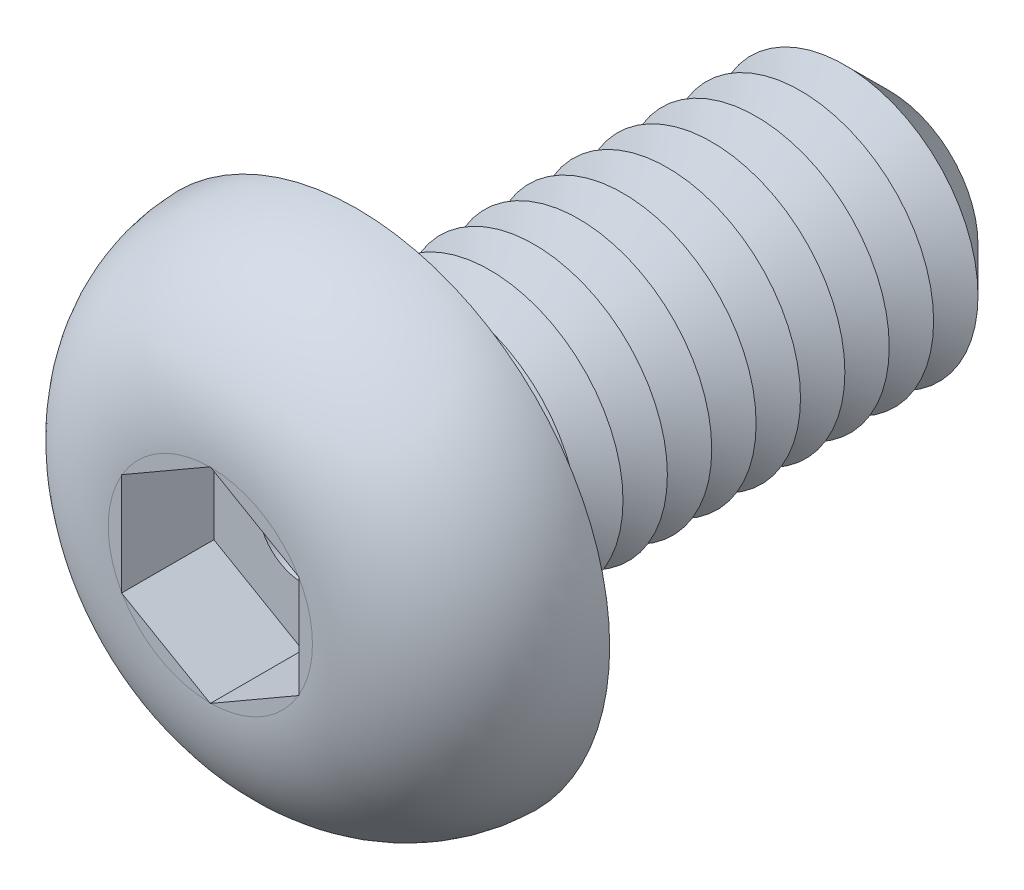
ISO-10303-21;
HEADER;
FILE_DESCRIPTION(('STEP AP214'),'2;1');
FILE_NAME('part.step','',(''),(''),'','','');
FILE_SCHEMA(('AUTOMOTIVE_DESIGN { 1 0 10303 214 1 1 1 1 }'));
ENDSEC;
DATA;
#1=APPLICATION_CONTEXT('core data for automotive mechanical design processes');
#2=APPLICATION_PROTOCOL_DEFINITION('international standard','automotive_design',2000,#1);
#3=PRODUCT_CONTEXT('',#1,'mechanical');
#4=PRODUCT('Part','Part','',(#3));
#5=PRODUCT_RELATED_PRODUCT_CATEGORY('part','',(#4));
#6=PRODUCT_DEFINITION_FORMATION('','',#4);
#7=PRODUCT_DEFINITION_CONTEXT('part definition',#1,'design');
#8=PRODUCT_DEFINITION('design','',#6,#7);
#9=PRODUCT_DEFINITION_SHAPE('','',#8);
#10=(LENGTH_UNIT() NAMED_UNIT(*) SI_UNIT(.MILLI.,.METRE.));
#11=(NAMED_UNIT(*) PLANE_ANGLE_UNIT() SI_UNIT($,.RADIAN.));
#12=(NAMED_UNIT(*) SI_UNIT($,.STERADIAN.) SOLID_ANGLE_UNIT());
#13=UNCERTAINTY_MEASURE_WITH_UNIT(LENGTH_MEASURE(1.E-05),#10,'distance_accuracy_value','');
#14=(GEOMETRIC_REPRESENTATION_CONTEXT(3) GLOBAL_UNCERTAINTY_ASSIGNED_CONTEXT((#13)) GLOBAL_UNIT_ASSIGNED_CONTEXT((#10,
#11,#12)) REPRESENTATION_CONTEXT('',''));
#15=CARTESIAN_POINT('',(0.,0.,0.));
#16=DIRECTION('',(0.,0.,1.));
#17=DIRECTION('',(1.,0.,0.));
#18=AXIS2_PLACEMENT_3D('',#15,#16,#17);
#19=CARTESIAN_POINT('',(0.,0.,-6.));
#20=DIRECTION('',(0.,0.,1.));
#21=DIRECTION('',(1.,0.,0.));
#22=AXIS2_PLACEMENT_3D('',#19,#20,#21);
#23=CYLINDRICAL_SURFACE('',#22,1.5);
#24=CARTESIAN_POINT('',(0.,0.,-0.25));
#25=DIRECTION('',(0.,0.,1.));
#26=DIRECTION('',(1.,0.,0.));
#27=AXIS2_PLACEMENT_3D('',#24,#25,#26);
#28=CIRCLE('',#27,1.5);
#29=CARTESIAN_POINT('',(1.5,0.,-0.25));
#30=VERTEX_POINT('',#29);
#31=EDGE_CURVE('E48',#30,#30,#28,.F.);
#32=ORIENTED_EDGE('',*,*,#31,.T.);
#33=EDGE_LOOP('',(#32));
#34=FACE_BOUND('',#33,.T.);
#35=CARTESIAN_POINT('',(0.,0.,-0.5));
#36=DIRECTION('',(0.,0.,1.));
#37=DIRECTION('',(1.,0.,0.));
#38=AXIS2_PLACEMENT_3D('',#35,#36,#37);
#39=CIRCLE('',#38,1.5);
#40=CARTESIAN_POINT('',(1.5,0.,-0.5));
#41=VERTEX_POINT('',#40);
#42=EDGE_CURVE('E160',#41,#41,#39,.T.);
#43=ORIENTED_EDGE('',*,*,#42,.T.);
#44=EDGE_LOOP('',(#43));
#45=FACE_BOUND('',#44,.T.);
#46=ADVANCED_FACE('F39',(#34,#45),#23,.T.);
#47=CARTESIAN_POINT('',(0.,0.,1.65));
#48=DIRECTION('',(0.,0.,-1.));
#49=DIRECTION('',(-1.,0.,0.));
#50=AXIS2_PLACEMENT_3D('',#47,#48,#49);
#51=PLANE('',#50);
#52=CARTESIAN_POINT('',(0.,0.,1.65));
#53=DIRECTION('',(0.,0.,1.));
#54=DIRECTION('',(1.,0.,0.));
#55=AXIS2_PLACEMENT_3D('',#52,#53,#54);
#56=CIRCLE('',#55,1.15073545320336);
#57=CARTESIAN_POINT('',(0.993096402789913,0.581336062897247,1.65));
#58=VERTEX_POINT('',#57);
#59=CARTESIAN_POINT('',(0.00690359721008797,1.15071474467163,1.65));
#60=VERTEX_POINT('',#59);
#61=EDGE_CURVE('E220',#58,#60,#56,.T.);
#62=ORIENTED_EDGE('',*,*,#61,.T.);
#63=DIRECTION('',(-0.866025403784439,0.5,0.));
#64=VECTOR('',#63,1.);
#65=CARTESIAN_POINT('',(1.,0.577350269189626,1.65));
#66=LINE('',#65,#64);
#67=EDGE_CURVE('E178',#58,#60,#66,.T.);
#68=ORIENTED_EDGE('',*,*,#67,.F.);
#69=EDGE_LOOP('',(#62,#68));
#70=FACE_BOUND('',#69,.T.);
#71=ADVANCED_FACE('F257',(#70),#51,.F.);
#72=CARTESIAN_POINT('',(1.,-0.569378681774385,1.65));
#73=VERTEX_POINT('',#72);
#74=CARTESIAN_POINT('',(1.,0.569378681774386,1.65));
#75=VERTEX_POINT('',#74);
#76=EDGE_CURVE('E215',#73,#75,#56,.T.);
#77=ORIENTED_EDGE('',*,*,#76,.T.);
#78=DIRECTION('',(0.,1.,0.));
#79=VECTOR('',#78,1.);
#80=CARTESIAN_POINT('',(1.,-0.577350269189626,1.65));
#81=LINE('',#80,#79);
#82=EDGE_CURVE('E63',#73,#75,#81,.T.);
#83=ORIENTED_EDGE('',*,*,#82,.F.);
#84=EDGE_LOOP('',(#77,#83));
#85=FACE_BOUND('',#84,.T.);
#86=ADVANCED_FACE('F263',(#85),#51,.F.);
#87=CARTESIAN_POINT('',(0.00690359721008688,-1.15071474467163,1.65));
#88=VERTEX_POINT('',#87);
#89=CARTESIAN_POINT('',(0.993096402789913,-0.581336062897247,1.65));
#90=VERTEX_POINT('',#89);
#91=EDGE_CURVE('E219',#88,#90,#56,.T.);
#92=ORIENTED_EDGE('',*,*,#91,.T.);
#93=DIRECTION('',(0.866025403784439,0.5,0.));
#94=VECTOR('',#93,1.);
#95=CARTESIAN_POINT('',(0.,-1.15470053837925,1.65));
#96=LINE('',#95,#94);
#97=EDGE_CURVE('E190',#88,#90,#96,.T.);
#98=ORIENTED_EDGE('',*,*,#97,.F.);
#99=EDGE_LOOP('',(#92,#98));
#100=FACE_BOUND('',#99,.T.);
#101=ADVANCED_FACE('F326',(#100),#51,.F.);
#102=CARTESIAN_POINT('',(-0.993096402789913,-0.581336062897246,1.65));
#103=VERTEX_POINT('',#102);
#104=CARTESIAN_POINT('',(-0.00690359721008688,-1.15071474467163,1.65));
#105=VERTEX_POINT('',#104);
#106=EDGE_CURVE('E336',#103,#105,#56,.T.);
#107=ORIENTED_EDGE('',*,*,#106,.T.);
#108=DIRECTION('',(0.866025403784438,-0.5,0.));
#109=VECTOR('',#108,1.);
#110=CARTESIAN_POINT('',(-1.,-0.577350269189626,1.65));
#111=LINE('',#110,#109);
#112=EDGE_CURVE('E186',#103,#105,#111,.T.);
#113=ORIENTED_EDGE('',*,*,#112,.F.);
#114=EDGE_LOOP('',(#107,#113));
#115=FACE_BOUND('',#114,.T.);
#116=ADVANCED_FACE('F321',(#115),#51,.F.);
#117=CARTESIAN_POINT('',(-1.,0.569378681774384,1.65));
#118=VERTEX_POINT('',#117);
#119=CARTESIAN_POINT('',(-1.,-0.569378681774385,1.65));
#120=VERTEX_POINT('',#119);
#121=EDGE_CURVE('E331',#118,#120,#56,.T.);
#122=ORIENTED_EDGE('',*,*,#121,.T.);
#123=DIRECTION('',(0.,-1.,0.));
#124=VECTOR('',#123,1.);
#125=CARTESIAN_POINT('',(-1.,0.577350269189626,1.65));
#126=LINE('',#125,#124);
#127=EDGE_CURVE('E182',#118,#120,#126,.T.);
#128=ORIENTED_EDGE('',*,*,#127,.F.);
#129=EDGE_LOOP('',(#122,#128));
#130=FACE_BOUND('',#129,.T.);
#131=ADVANCED_FACE('F312',(#130),#51,.F.);
#132=CARTESIAN_POINT('',(0.,2.85,0.));
#133=DIRECTION('',(0.,0.,1.));
#134=DIRECTION('',(1.,0.,0.));
#135=AXIS2_PLACEMENT_3D('',#132,#133,#134);
#136=PLANE('',#135);
#137=CARTESIAN_POINT('',(0.,0.,0.));
#138=DIRECTION('',(0.,0.,1.));
#139=DIRECTION('',(1.,0.,0.));
#140=AXIS2_PLACEMENT_3D('',#137,#138,#139);
#141=CIRCLE('',#140,1.75);
#142=CARTESIAN_POINT('',(1.75,0.,0.));
#143=VERTEX_POINT('',#142);
#144=EDGE_CURVE('E11',#143,#143,#141,.T.);
#145=ORIENTED_EDGE('',*,*,#144,.T.);
#146=EDGE_LOOP('',(#145));
#147=FACE_BOUND('',#146,.T.);
#148=CARTESIAN_POINT('',(0.,0.,0.));
#149=DIRECTION('',(0.,0.,1.));
#150=DIRECTION('',(1.,0.,0.));
#151=AXIS2_PLACEMENT_3D('',#148,#149,#150);
#152=CIRCLE('',#151,2.85);
#153=CARTESIAN_POINT('',(2.85,0.,0.));
#154=VERTEX_POINT('',#153);
#155=EDGE_CURVE('E197',#154,#154,#152,.T.);
#156=ORIENTED_EDGE('',*,*,#155,.F.);
#157=EDGE_LOOP('',(#156));
#158=FACE_BOUND('',#157,.T.);
#159=ADVANCED_FACE('F309',(#147,#158),#136,.F.);
#160=CARTESIAN_POINT('',(-0.00690359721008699,1.15071474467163,1.65));
#161=VERTEX_POINT('',#160);
#162=CARTESIAN_POINT('',(-0.993096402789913,0.581336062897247,1.65));
#163=VERTEX_POINT('',#162);
#164=EDGE_CURVE('E335',#161,#163,#56,.T.);
#165=ORIENTED_EDGE('',*,*,#164,.T.);
#166=DIRECTION('',(-0.866025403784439,-0.5,0.));
#167=VECTOR('',#166,1.);
#168=CARTESIAN_POINT('',(0.,1.15470053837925,1.65));
#169=LINE('',#168,#167);
#170=EDGE_CURVE('E177',#161,#163,#169,.T.);
#171=ORIENTED_EDGE('',*,*,#170,.F.);
#172=EDGE_LOOP('',(#165,#171));
#173=FACE_BOUND('',#172,.T.);
#174=ADVANCED_FACE('F254',(#173),#51,.F.);
#175=CARTESIAN_POINT('',(0.,0.,-0.0499999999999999));
#176=DIRECTION('',(0.,0.,1.));
#177=DIRECTION('',(1.,0.,0.));
#178=AXIS2_PLACEMENT_3D('',#175,#176,#177);
#179=DEGENERATE_TOROIDAL_SURFACE('',#178,1.15073545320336,1.7,.T.);
#180=ORIENTED_EDGE('',*,*,#61,.F.);
#181=CARTESIAN_POINT('',(1.,0.577350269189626,1.65));
#182=VERTEX_POINT('',#181);
#183=EDGE_CURVE('E174',#182,#58,#66,.T.);
#184=ORIENTED_EDGE('',*,*,#183,.F.);
#185=CARTESIAN_POINT('',(1.,0.,1.64330411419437));
#186=CARTESIAN_POINT('',(1.,-0.0418495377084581,1.64330316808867));
#187=CARTESIAN_POINT('',(1.,-0.0836989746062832,1.64354559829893));
#188=CARTESIAN_POINT('',(1.,-0.167393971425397,1.64442358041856));
#189=CARTESIAN_POINT('',(1.,-0.209239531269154,1.64505913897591));
#190=CARTESIAN_POINT('',(1.,-0.334845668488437,1.64722576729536));
#191=CARTESIAN_POINT('',(1.,-0.418601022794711,1.64901611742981));
#192=CARTESIAN_POINT('',(1.,-0.585792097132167,1.65039211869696));
#193=CARTESIAN_POINT('',(1.,-0.669227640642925,1.64998722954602));
#194=CARTESIAN_POINT('',(1.,-0.83590094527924,1.6440300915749));
#195=CARTESIAN_POINT('',(1.,-0.919138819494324,1.63848280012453));
#196=CARTESIAN_POINT('',(1.,-1.0594136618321,1.62282805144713));
#197=CARTESIAN_POINT('',(1.,-1.11666006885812,1.61463991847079));
#198=CARTESIAN_POINT('',(1.,-1.23041128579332,1.59417176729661));
#199=CARTESIAN_POINT('',(1.,-1.2869163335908,1.58189309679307));
#200=CARTESIAN_POINT('',(1.,-1.39883762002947,1.55283610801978));
#201=CARTESIAN_POINT('',(1.,-1.45425254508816,1.53605268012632));
#202=CARTESIAN_POINT('',(1.,-1.56342884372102,1.49775525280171));
#203=CARTESIAN_POINT('',(1.,-1.61719032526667,1.47624156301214));
#204=CARTESIAN_POINT('',(1.,-1.72305248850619,1.42814032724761));
#205=CARTESIAN_POINT('',(1.,-1.77513121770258,1.40150424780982));
#206=CARTESIAN_POINT('',(1.,-1.87650034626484,1.34331391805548));
#207=CARTESIAN_POINT('',(1.,-1.92578956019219,1.31175759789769));
#208=CARTESIAN_POINT('',(1.,-2.02094663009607,1.24389579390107));
#209=CARTESIAN_POINT('',(1.,-2.06681670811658,1.20759343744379));
#210=CARTESIAN_POINT('',(1.,-2.15460705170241,1.13048515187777));
#211=CARTESIAN_POINT('',(1.,-2.19652613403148,1.08967788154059));
#212=CARTESIAN_POINT('',(1.,-2.30373588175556,0.973753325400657));
#213=CARTESIAN_POINT('',(1.,-2.36480639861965,0.894640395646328));
#214=CARTESIAN_POINT('',(1.,-2.47150299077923,0.726696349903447));
#215=CARTESIAN_POINT('',(1.,-2.51713890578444,0.637871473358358));
#216=CARTESIAN_POINT('',(1.,-2.58857066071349,0.46005750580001));
#217=CARTESIAN_POINT('',(1.,-2.61556805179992,0.371550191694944));
#218=CARTESIAN_POINT('',(1.,-2.65390085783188,0.191213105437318));
#219=CARTESIAN_POINT('',(1.,-2.66523955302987,0.0993840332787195));
#220=CARTESIAN_POINT('',(1.,-2.67179092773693,-0.0825708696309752));
#221=CARTESIAN_POINT('',(1.,-2.66739421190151,-0.17268289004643));
#222=CARTESIAN_POINT('',(1.,-2.64348567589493,-0.350883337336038));
#223=CARTESIAN_POINT('',(1.,-2.62397312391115,-0.438971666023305));
#224=CARTESIAN_POINT('',(1.,-2.57054048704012,-0.610404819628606));
#225=CARTESIAN_POINT('',(1.,-2.53665793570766,-0.693761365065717));
#226=CARTESIAN_POINT('',(1.,-2.45559893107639,-0.85368978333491));
#227=CARTESIAN_POINT('',(1.,-2.40842683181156,-0.930263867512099));
#228=CARTESIAN_POINT('',(1.,-2.30144802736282,-1.07583692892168));
#229=CARTESIAN_POINT('',(1.,-2.24145688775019,-1.14470015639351));
#230=CARTESIAN_POINT('',(1.,-2.11112251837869,-1.27193159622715));
#231=CARTESIAN_POINT('',(1.,-2.04076746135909,-1.33028764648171));
#232=CARTESIAN_POINT('',(1.,-1.88862864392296,-1.43765509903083));
#233=CARTESIAN_POINT('',(1.,-1.80648025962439,-1.48614793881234));
#234=CARTESIAN_POINT('',(1.,-1.63600727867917,-1.56989445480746));
#235=CARTESIAN_POINT('',(1.,-1.54769931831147,-1.60518226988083));
#236=CARTESIAN_POINT('',(1.,-1.39091080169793,-1.65552596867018));
#237=CARTESIAN_POINT('',(1.,-1.32332513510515,-1.67346211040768));
#238=CARTESIAN_POINT('',(1.,-1.18678249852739,-1.70305339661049));
#239=CARTESIAN_POINT('',(1.,-1.11782507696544,-1.71470643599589));
#240=CARTESIAN_POINT('',(1.,-0.978842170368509,-1.73262758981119));
#241=CARTESIAN_POINT('',(1.,-0.908812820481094,-1.73886428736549));
#242=CARTESIAN_POINT('',(1.,-0.768519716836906,-1.74708473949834));
#243=CARTESIAN_POINT('',(1.,-0.698255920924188,-1.74906768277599));
#244=CARTESIAN_POINT('',(1.,-0.527772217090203,-1.75068316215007));
#245=CARTESIAN_POINT('',(1.,-0.427552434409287,-1.74895318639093));
#246=CARTESIAN_POINT('',(1.,-0.27725595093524,-1.74623781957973));
#247=CARTESIAN_POINT('',(1.,-0.227169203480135,-1.74531275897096));
#248=CARTESIAN_POINT('',(1.,-0.126990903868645,-1.74392135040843));
#249=CARTESIAN_POINT('',(1.,-0.0768993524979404,-1.74345496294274));
#250=CARTESIAN_POINT('',(1.,0.02329543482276,-1.7432171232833));
#251=CARTESIAN_POINT('',(1.,0.073398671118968,-1.74344580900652));
#252=CARTESIAN_POINT('',(1.,0.173601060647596,-1.74448066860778));
#253=CARTESIAN_POINT('',(1.,0.223700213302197,-1.74528688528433));
#254=CARTESIAN_POINT('',(1.,0.374032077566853,-1.74796102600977));
#255=CARTESIAN_POINT('',(1.,0.474263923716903,-1.7500840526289));
#256=CARTESIAN_POINT('',(1.,0.646038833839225,-1.74993675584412));
#257=CARTESIAN_POINT('',(1.,0.717572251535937,-1.74875105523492));
#258=CARTESIAN_POINT('',(1.,0.860467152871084,-1.74232930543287));
#259=CARTESIAN_POINT('',(0.999999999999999,0.931828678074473,-1.73709436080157));
#260=CARTESIAN_POINT('',(0.999999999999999,1.07356885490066,-1.72122033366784));
#261=CARTESIAN_POINT('',(0.999999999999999,1.14395079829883,-1.71061248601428));
#262=CARTESIAN_POINT('',(0.999999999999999,1.28345101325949,-1.6830362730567));
#263=CARTESIAN_POINT('',(0.999999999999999,1.35256960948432,-1.66606956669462));
#264=CARTESIAN_POINT('',(0.999999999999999,1.51915230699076,-1.61597650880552));
#265=CARTESIAN_POINT('',(0.999999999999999,1.61551282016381,-1.5790180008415));
#266=CARTESIAN_POINT('',(0.999999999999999,1.80117858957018,-1.48957694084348));
#267=CARTESIAN_POINT('',(0.999999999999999,1.89046083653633,-1.43704619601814));
#268=CARTESIAN_POINT('',(0.999999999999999,2.05877104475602,-1.31682583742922));
#269=CARTESIAN_POINT('',(0.999999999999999,2.13775712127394,-1.24907718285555));
#270=CARTESIAN_POINT('',(0.999999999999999,2.28184060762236,-1.10027015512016));
#271=CARTESIAN_POINT('',(0.999999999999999,2.34695771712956,-1.01923095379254));
#272=CARTESIAN_POINT('',(0.999999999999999,2.45608578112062,-0.853423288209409));
#273=CARTESIAN_POINT('',(0.999999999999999,2.5013878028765,-0.769502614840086));
#274=CARTESIAN_POINT('',(0.999999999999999,2.5765359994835,-0.594973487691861));
#275=CARTESIAN_POINT('',(0.999999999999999,2.60638146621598,-0.504364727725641));
#276=CARTESIAN_POINT('',(0.999999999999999,2.64857466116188,-0.323348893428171));
#277=CARTESIAN_POINT('',(0.999999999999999,2.66163020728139,-0.2331061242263));
#278=CARTESIAN_POINT('',(0.999999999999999,2.67217366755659,-0.0517287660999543));
#279=CARTESIAN_POINT('',(0.999999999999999,2.66966509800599,0.0394056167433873));
#280=CARTESIAN_POINT('',(0.999999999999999,2.64931179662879,0.218675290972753));
#281=CARTESIAN_POINT('',(0.999999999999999,2.63167707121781,0.306834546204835));
#282=CARTESIAN_POINT('',(0.999999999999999,2.58192713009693,0.478965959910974));
#283=CARTESIAN_POINT('',(0.999999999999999,2.54981137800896,0.562937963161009));
#284=CARTESIAN_POINT('',(0.999999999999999,2.47193161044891,0.724823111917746));
#285=CARTESIAN_POINT('',(0.999999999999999,2.42609746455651,0.802702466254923));
#286=CARTESIAN_POINT('',(0.999999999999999,2.32231485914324,0.949889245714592));
#287=CARTESIAN_POINT('',(0.999999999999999,2.26436747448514,1.01919743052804));
#288=CARTESIAN_POINT('',(0.999999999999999,2.13654618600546,1.14929270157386));
#289=CARTESIAN_POINT('',(0.999999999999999,2.0664051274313,1.20981647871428));
#290=CARTESIAN_POINT('',(0.999999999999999,1.9173872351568,1.31904487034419));
#291=CARTESIAN_POINT('',(0.999999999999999,1.83850453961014,1.36774148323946));
#292=CARTESIAN_POINT('',(0.999999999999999,1.71289874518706,1.4328215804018));
#293=CARTESIAN_POINT('',(0.999999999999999,1.66841297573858,1.45365843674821));
#294=CARTESIAN_POINT('',(0.999999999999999,1.57796501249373,1.49187589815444));
#295=CARTESIAN_POINT('',(0.999999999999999,1.53200259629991,1.50925597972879));
#296=CARTESIAN_POINT('',(0.999999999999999,1.43903939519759,1.54059227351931));
#297=CARTESIAN_POINT('',(0.999999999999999,1.39204097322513,1.55455554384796));
#298=CARTESIAN_POINT('',(0.999999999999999,1.29722920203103,1.57925913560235));
#299=CARTESIAN_POINT('',(0.999999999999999,1.24941611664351,1.59000048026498));
#300=CARTESIAN_POINT('',(0.999999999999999,1.10320842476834,1.61808076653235));
#301=CARTESIAN_POINT('',(0.999999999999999,1.00389041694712,1.63067408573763));
#302=CARTESIAN_POINT('',(0.999999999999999,0.804462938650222,1.6463207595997));
#303=CARTESIAN_POINT('',(1.,0.704352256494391,1.64935433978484));
#304=CARTESIAN_POINT('',(1.,0.503474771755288,1.65046619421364));
#305=CARTESIAN_POINT('',(0.999999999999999,0.402708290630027,1.64850957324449));
#306=CARTESIAN_POINT('',(1.,0.251622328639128,1.64577086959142));
#307=CARTESIAN_POINT('',(1.,0.201301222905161,1.64489114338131));
#308=CARTESIAN_POINT('',(1.,0.100653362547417,1.64365834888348));
#309=CARTESIAN_POINT('',(1.,0.0503266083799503,1.64330525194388));
#310=CARTESIAN_POINT('',(1.,0.,1.64330411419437));
#311=B_SPLINE_CURVE_WITH_KNOTS('',3,(#185,#186,#187,#188,#189,#190,#191,#192,#193,#194,#195,
#196,#197,#198,#199,#200,#201,#202,#203,#204,#205,#206,#207,#208,#209,#210,#211,#212,#213,#214,
#215,#216,#217,#218,#219,#220,#221,#222,#223,#224,#225,#226,#227,#228,#229,#230,#231,#232,#233,
#234,#235,#236,#237,#238,#239,#240,#241,#242,#243,#244,#245,#246,#247,#248,#249,#250,#251,#252,
#253,#254,#255,#256,#257,#258,#259,#260,#261,#262,#263,#264,#265,#266,#267,#268,#269,#270,#271,
#272,#273,#274,#275,#276,#277,#278,#279,#280,#281,#282,#283,#284,#285,#286,#287,#288,#289,#290,
#291,#292,#293,#294,#295,#296,#297,#298,#299,#300,#301,#302,#303,#304,#305,#306,#307,#308,#309,
#310),.UNSPECIFIED.,.T.,.F.,(4,2,2,2,2,2,2,2,2,2,2,2,2,2,2,2,2,2,2,2,2,2,2,2,2,2,2,2,2,2,2,2,2,
2,2,2,2,2,2,2,2,2,2,2,2,2,2,2,2,2,2,2,2,2,2,2,2,2,2,2,2,2,4),(0.,0.125547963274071,
0.251098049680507,0.502422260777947,0.752664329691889,1.00266541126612,1.17602519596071,
1.34932792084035,1.52282805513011,1.69631683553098,1.87153849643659,2.04683406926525,
2.22201470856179,2.39724764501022,2.69534138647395,2.99324473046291,3.26948200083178,
3.54566139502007,3.81503317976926,4.08441800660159,4.35310350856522,4.62170108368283,
4.89446026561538,5.16753316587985,5.45251589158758,5.73675667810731,5.94622800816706,
6.15576947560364,6.3665183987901,6.57730751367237,6.87796487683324,7.02825425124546,
7.17853067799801,7.32883692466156,7.47915431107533,7.77989491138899,7.99445526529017,
8.20895711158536,8.42222604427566,8.63543937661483,8.94372593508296,9.25297671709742,
9.56344868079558,9.87347666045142,10.1581355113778,10.4428074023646,10.715036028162,
10.9872031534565,11.2556516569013,11.5241101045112,11.7939650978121,12.0637961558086,
12.3405292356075,12.6174490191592,12.7646985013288,12.9119702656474,13.0589351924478,
13.2058533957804,13.5054664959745,13.8056989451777,14.1080365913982,14.2590238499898,
14.410002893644),.UNSPECIFIED.);
#312=EDGE_CURVE('E278',#182,#75,#311,.T.);
#313=ORIENTED_EDGE('',*,*,#312,.T.);
#314=ORIENTED_EDGE('',*,*,#76,.F.);
#315=CARTESIAN_POINT('',(1.,-0.577350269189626,1.65));
#316=VERTEX_POINT('',#315);
#317=EDGE_CURVE('E154',#316,#73,#81,.T.);
#318=ORIENTED_EDGE('',*,*,#317,.F.);
#319=CARTESIAN_POINT('',(1.0002,-0.577234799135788,1.64999510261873));
#320=CARTESIAN_POINT('',(0.958507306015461,-0.601306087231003,1.65004608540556));
#321=CARTESIAN_POINT('',(0.916820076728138,-0.625374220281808,1.64959104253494));
#322=CARTESIAN_POINT('',(0.83344664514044,-0.673509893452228,1.64822305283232));
#323=CARTESIAN_POINT('',(0.791760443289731,-0.697577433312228,1.6473100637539));
#324=CARTESIAN_POINT('',(0.708395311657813,-0.745708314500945,1.64558069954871));
#325=CARTESIAN_POINT('',(0.666716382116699,-0.769771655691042,1.64476430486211));
#326=CARTESIAN_POINT('',(0.58335598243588,-0.817899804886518,1.64362601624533));
#327=CARTESIAN_POINT('',(0.541674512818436,-0.841964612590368,1.64330408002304));
#328=CARTESIAN_POINT('',(0.45831273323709,-0.890093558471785,1.64330414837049));
#329=CARTESIAN_POINT('',(0.416632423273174,-0.914157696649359,1.64362613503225));
#330=CARTESIAN_POINT('',(0.333274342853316,-0.962284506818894,1.64476447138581));
#331=CARTESIAN_POINT('',(0.291596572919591,-0.986347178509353,1.64558086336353));
#332=CARTESIAN_POINT('',(0.208233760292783,-1.03447672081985,1.64731018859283));
#333=CARTESIAN_POINT('',(0.166548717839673,-1.05854359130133,1.64822314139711));
#334=CARTESIAN_POINT('',(0.0831776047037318,-1.106677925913,1.64959106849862));
#335=CARTESIAN_POINT('',(0.0414915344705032,-1.13074538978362,1.65004608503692));
#336=CARTESIAN_POINT('',(-0.00020000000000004,-1.15481600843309,1.64999510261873));
#337=B_SPLINE_CURVE_WITH_KNOTS('',3,(#319,#320,#321,#322,#323,#324,#325,#326,#327,#328,#329,
#330,#331,#332,#333,#334,#335,#336),.UNSPECIFIED.,.F.,.F.,(4,2,2,2,2,2,2,2,4),(0.,
0.144416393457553,0.288846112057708,0.433246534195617,0.577634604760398,0.722018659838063,
0.866415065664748,1.01084076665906,1.15525314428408),.UNSPECIFIED.);
#338=EDGE_CURVE('E285',#316,#90,#337,.T.);
#339=ORIENTED_EDGE('',*,*,#338,.T.);
#340=ORIENTED_EDGE('',*,*,#91,.F.);
#341=CARTESIAN_POINT('',(0.,-1.15470053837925,1.65));
#342=VERTEX_POINT('',#341);
#343=EDGE_CURVE('E191',#342,#88,#96,.T.);
#344=ORIENTED_EDGE('',*,*,#343,.F.);
#345=CARTESIAN_POINT('',(0.000199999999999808,-1.15481600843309,1.64999510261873));
#346=CARTESIAN_POINT('',(-0.0414926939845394,-1.13074472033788,1.65004608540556));
#347=CARTESIAN_POINT('',(-0.0831799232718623,-1.10667658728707,1.64959104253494));
#348=CARTESIAN_POINT('',(-0.166553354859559,-1.05854091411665,1.64822305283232));
#349=CARTESIAN_POINT('',(-0.208239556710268,-1.03447337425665,1.6473100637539));
#350=CARTESIAN_POINT('',(-0.291604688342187,-0.986342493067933,1.64558069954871));
#351=CARTESIAN_POINT('',(-0.333283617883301,-0.962279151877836,1.64476430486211));
#352=CARTESIAN_POINT('',(-0.41664401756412,-0.91415100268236,1.64362601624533));
#353=CARTESIAN_POINT('',(-0.458325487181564,-0.89008619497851,1.64330408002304));
#354=CARTESIAN_POINT('',(-0.54168726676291,-0.841957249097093,1.64330414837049));
#355=CARTESIAN_POINT('',(-0.583367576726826,-0.817893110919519,1.64362613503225));
#356=CARTESIAN_POINT('',(-0.666725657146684,-0.769766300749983,1.64476447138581));
#357=CARTESIAN_POINT('',(-0.708403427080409,-0.745703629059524,1.64558086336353));
#358=CARTESIAN_POINT('',(-0.791766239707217,-0.697574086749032,1.64731018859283));
#359=CARTESIAN_POINT('',(-0.833451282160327,-0.673507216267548,1.64822314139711));
#360=CARTESIAN_POINT('',(-0.916822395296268,-0.625372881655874,1.64959106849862));
#361=CARTESIAN_POINT('',(-0.958508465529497,-0.601305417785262,1.65004608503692));
#362=CARTESIAN_POINT('',(-1.0002,-0.577234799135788,1.64999510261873));
#363=B_SPLINE_CURVE_WITH_KNOTS('',3,(#345,#346,#347,#348,#349,#350,#351,#352,#353,#354,#355,
#356,#357,#358,#359,#360,#361,#362),.UNSPECIFIED.,.F.,.F.,(4,2,2,2,2,2,2,2,4),(0.,
0.144416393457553,0.288846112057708,0.433246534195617,0.577634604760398,0.722018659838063,
0.866415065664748,1.01084076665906,1.15525314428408),.UNSPECIFIED.);
#364=EDGE_CURVE('E361',#342,#105,#363,.T.);
#365=ORIENTED_EDGE('',*,*,#364,.T.);
#366=ORIENTED_EDGE('',*,*,#106,.F.);
#367=CARTESIAN_POINT('',(-1.,-0.577350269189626,1.65));
#368=VERTEX_POINT('',#367);
#369=EDGE_CURVE('E187',#368,#103,#111,.T.);
#370=ORIENTED_EDGE('',*,*,#369,.F.);
#371=CARTESIAN_POINT('',(-1.,0.,1.64330411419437));
#372=CARTESIAN_POINT('',(-1.,0.0418495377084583,1.64330316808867));
#373=CARTESIAN_POINT('',(-1.,0.0836989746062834,1.64354559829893));
#374=CARTESIAN_POINT('',(-1.,0.167393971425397,1.64442358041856));
#375=CARTESIAN_POINT('',(-1.,0.209239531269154,1.64505913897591));
#376=CARTESIAN_POINT('',(-1.,0.334845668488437,1.64722576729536));
#377=CARTESIAN_POINT('',(-1.,0.418601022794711,1.64901611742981));
#378=CARTESIAN_POINT('',(-1.,0.585792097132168,1.65039211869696));
#379=CARTESIAN_POINT('',(-1.,0.669227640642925,1.64998722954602));
#380=CARTESIAN_POINT('',(-1.,0.835900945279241,1.6440300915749));
#381=CARTESIAN_POINT('',(-1.,0.919138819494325,1.63848280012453));
#382=CARTESIAN_POINT('',(-1.,1.0594136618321,1.62282805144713));
#383=CARTESIAN_POINT('',(-1.,1.11666006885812,1.61463991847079));
#384=CARTESIAN_POINT('',(-1.,1.23041128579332,1.59417176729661));
#385=CARTESIAN_POINT('',(-1.,1.2869163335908,1.58189309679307));
#386=CARTESIAN_POINT('',(-1.,1.39883762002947,1.55283610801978));
#387=CARTESIAN_POINT('',(-1.,1.45425254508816,1.53605268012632));
#388=CARTESIAN_POINT('',(-1.,1.56342884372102,1.49775525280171));
#389=CARTESIAN_POINT('',(-1.,1.61719032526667,1.47624156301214));
#390=CARTESIAN_POINT('',(-1.,1.72305248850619,1.42814032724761));
#391=CARTESIAN_POINT('',(-1.,1.77513121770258,1.40150424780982));
#392=CARTESIAN_POINT('',(-1.,1.87650034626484,1.34331391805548));
#393=CARTESIAN_POINT('',(-1.,1.92578956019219,1.31175759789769));
#394=CARTESIAN_POINT('',(-1.,2.02094663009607,1.24389579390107));
#395=CARTESIAN_POINT('',(-1.,2.06681670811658,1.20759343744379));
#396=CARTESIAN_POINT('',(-1.,2.15460705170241,1.13048515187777));
#397=CARTESIAN_POINT('',(-1.,2.19652613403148,1.08967788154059));
#398=CARTESIAN_POINT('',(-1.,2.30373588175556,0.973753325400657));
#399=CARTESIAN_POINT('',(-1.,2.36480639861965,0.894640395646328));
#400=CARTESIAN_POINT('',(-1.,2.47150299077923,0.726696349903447));
#401=CARTESIAN_POINT('',(-1.,2.51713890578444,0.637871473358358));
#402=CARTESIAN_POINT('',(-1.,2.58857066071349,0.46005750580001));
#403=CARTESIAN_POINT('',(-1.,2.61556805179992,0.371550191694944));
#404=CARTESIAN_POINT('',(-1.,2.65390085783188,0.191213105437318));
#405=CARTESIAN_POINT('',(-1.,2.66523955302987,0.0993840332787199));
#406=CARTESIAN_POINT('',(-1.,2.67179092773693,-0.0825708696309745));
#407=CARTESIAN_POINT('',(-1.,2.66739421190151,-0.17268289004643));
#408=CARTESIAN_POINT('',(-1.,2.64348567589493,-0.350883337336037));
#409=CARTESIAN_POINT('',(-1.,2.62397312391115,-0.438971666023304));
#410=CARTESIAN_POINT('',(-1.,2.57054048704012,-0.610404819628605));
#411=CARTESIAN_POINT('',(-1.,2.53665793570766,-0.693761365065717));
#412=CARTESIAN_POINT('',(-1.,2.45559893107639,-0.853689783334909));
#413=CARTESIAN_POINT('',(-1.,2.40842683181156,-0.930263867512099));
#414=CARTESIAN_POINT('',(-1.,2.30144802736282,-1.07583692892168));
#415=CARTESIAN_POINT('',(-1.,2.24145688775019,-1.14470015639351));
#416=CARTESIAN_POINT('',(-1.,2.11112251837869,-1.27193159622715));
#417=CARTESIAN_POINT('',(-1.,2.04076746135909,-1.33028764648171));
#418=CARTESIAN_POINT('',(-1.,1.88862864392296,-1.43765509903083));
#419=CARTESIAN_POINT('',(-1.,1.80648025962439,-1.48614793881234));
#420=CARTESIAN_POINT('',(-1.,1.63600727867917,-1.56989445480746));
#421=CARTESIAN_POINT('',(-1.,1.54769931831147,-1.60518226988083));
#422=CARTESIAN_POINT('',(-1.,1.39091080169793,-1.65552596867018));
#423=CARTESIAN_POINT('',(-1.,1.32332513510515,-1.67346211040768));
#424=CARTESIAN_POINT('',(-1.,1.18678249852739,-1.70305339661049));
#425=CARTESIAN_POINT('',(-1.,1.11782507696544,-1.71470643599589));
#426=CARTESIAN_POINT('',(-1.,0.97884217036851,-1.73262758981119));
#427=CARTESIAN_POINT('',(-1.,0.908812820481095,-1.73886428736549));
#428=CARTESIAN_POINT('',(-1.,0.768519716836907,-1.74708473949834));
#429=CARTESIAN_POINT('',(-1.,0.698255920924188,-1.74906768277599));
#430=CARTESIAN_POINT('',(-1.,0.527772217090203,-1.75068316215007));
#431=CARTESIAN_POINT('',(-1.,0.427552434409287,-1.74895318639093));
#432=CARTESIAN_POINT('',(-1.,0.27725595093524,-1.74623781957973));
#433=CARTESIAN_POINT('',(-1.,0.227169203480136,-1.74531275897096));
#434=CARTESIAN_POINT('',(-1.,0.126990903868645,-1.74392135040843));
#435=CARTESIAN_POINT('',(-1.,0.0768993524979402,-1.74345496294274));
#436=CARTESIAN_POINT('',(-1.,-0.0232954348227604,-1.7432171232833));
#437=CARTESIAN_POINT('',(-1.,-0.0733986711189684,-1.74344580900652));
#438=CARTESIAN_POINT('',(-1.,-0.173601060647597,-1.74448066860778));
#439=CARTESIAN_POINT('',(-1.,-0.223700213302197,-1.74528688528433));
#440=CARTESIAN_POINT('',(-1.,-0.374032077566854,-1.74796102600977));
#441=CARTESIAN_POINT('',(-1.,-0.474263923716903,-1.7500840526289));
#442=CARTESIAN_POINT('',(-1.,-0.646038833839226,-1.74993675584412));
#443=CARTESIAN_POINT('',(-1.,-0.717572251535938,-1.74875105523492));
#444=CARTESIAN_POINT('',(-1.,-0.860467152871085,-1.74232930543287));
#445=CARTESIAN_POINT('',(-1.,-0.931828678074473,-1.73709436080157));
#446=CARTESIAN_POINT('',(-1.,-1.07356885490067,-1.72122033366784));
#447=CARTESIAN_POINT('',(-1.,-1.14395079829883,-1.71061248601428));
#448=CARTESIAN_POINT('',(-1.,-1.28345101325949,-1.6830362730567));
#449=CARTESIAN_POINT('',(-1.,-1.35256960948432,-1.66606956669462));
#450=CARTESIAN_POINT('',(-1.,-1.51915230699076,-1.61597650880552));
#451=CARTESIAN_POINT('',(-1.,-1.61551282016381,-1.5790180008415));
#452=CARTESIAN_POINT('',(-1.,-1.80117858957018,-1.48957694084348));
#453=CARTESIAN_POINT('',(-1.,-1.89046083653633,-1.43704619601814));
#454=CARTESIAN_POINT('',(-1.,-2.05877104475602,-1.31682583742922));
#455=CARTESIAN_POINT('',(-0.999999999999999,-2.13775712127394,-1.24907718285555));
#456=CARTESIAN_POINT('',(-0.999999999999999,-2.28184060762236,-1.10027015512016));
#457=CARTESIAN_POINT('',(-0.999999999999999,-2.34695771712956,-1.01923095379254));
#458=CARTESIAN_POINT('',(-0.999999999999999,-2.45608578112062,-0.85342328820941));
#459=CARTESIAN_POINT('',(-0.999999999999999,-2.50138780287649,-0.769502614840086));
#460=CARTESIAN_POINT('',(-0.999999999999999,-2.5765359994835,-0.594973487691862));
#461=CARTESIAN_POINT('',(-0.999999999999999,-2.60638146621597,-0.504364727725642));
#462=CARTESIAN_POINT('',(-0.999999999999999,-2.64857466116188,-0.323348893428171));
#463=CARTESIAN_POINT('',(-0.999999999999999,-2.66163020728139,-0.2331061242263));
#464=CARTESIAN_POINT('',(-0.999999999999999,-2.67217366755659,-0.0517287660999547));
#465=CARTESIAN_POINT('',(-0.999999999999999,-2.66966509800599,0.0394056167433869));
#466=CARTESIAN_POINT('',(-0.999999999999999,-2.64931179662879,0.218675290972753));
#467=CARTESIAN_POINT('',(-0.999999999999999,-2.63167707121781,0.306834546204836));
#468=CARTESIAN_POINT('',(-0.999999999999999,-2.58192713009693,0.478965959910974));
#469=CARTESIAN_POINT('',(-0.999999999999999,-2.54981137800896,0.562937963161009));
#470=CARTESIAN_POINT('',(-0.999999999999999,-2.47193161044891,0.724823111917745));
#471=CARTESIAN_POINT('',(-0.999999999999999,-2.42609746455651,0.802702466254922));
#472=CARTESIAN_POINT('',(-0.999999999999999,-2.32231485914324,0.949889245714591));
#473=CARTESIAN_POINT('',(-0.999999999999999,-2.26436747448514,1.01919743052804));
#474=CARTESIAN_POINT('',(-0.999999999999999,-2.13654618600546,1.14929270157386));
#475=CARTESIAN_POINT('',(-1.,-2.06640512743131,1.20981647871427));
#476=CARTESIAN_POINT('',(-1.,-1.9173872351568,1.31904487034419));
#477=CARTESIAN_POINT('',(-1.,-1.83850453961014,1.36774148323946));
#478=CARTESIAN_POINT('',(-1.,-1.71289874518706,1.4328215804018));
#479=CARTESIAN_POINT('',(-1.,-1.66841297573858,1.45365843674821));
#480=CARTESIAN_POINT('',(-1.,-1.57796501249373,1.49187589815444));
#481=CARTESIAN_POINT('',(-1.,-1.53200259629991,1.50925597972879));
#482=CARTESIAN_POINT('',(-1.,-1.43903939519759,1.54059227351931));
#483=CARTESIAN_POINT('',(-1.,-1.39204097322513,1.55455554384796));
#484=CARTESIAN_POINT('',(-1.,-1.29722920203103,1.57925913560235));
#485=CARTESIAN_POINT('',(-1.,-1.24941611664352,1.59000048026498));
#486=CARTESIAN_POINT('',(-1.,-1.10320842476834,1.61808076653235));
#487=CARTESIAN_POINT('',(-1.,-1.00389041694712,1.63067408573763));
#488=CARTESIAN_POINT('',(-1.,-0.804462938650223,1.6463207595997));
#489=CARTESIAN_POINT('',(-1.,-0.704352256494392,1.64935433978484));
#490=CARTESIAN_POINT('',(-1.,-0.503474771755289,1.65046619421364));
#491=CARTESIAN_POINT('',(-1.,-0.402708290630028,1.64850957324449));
#492=CARTESIAN_POINT('',(-1.,-0.251622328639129,1.64577086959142));
#493=CARTESIAN_POINT('',(-1.,-0.201301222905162,1.64489114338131));
#494=CARTESIAN_POINT('',(-1.,-0.100653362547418,1.64365834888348));
#495=CARTESIAN_POINT('',(-1.,-0.0503266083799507,1.64330525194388));
#496=CARTESIAN_POINT('',(-1.,0.,1.64330411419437));
#497=B_SPLINE_CURVE_WITH_KNOTS('',3,(#371,#372,#373,#374,#375,#376,#377,#378,#379,#380,#381,
#382,#383,#384,#385,#386,#387,#388,#389,#390,#391,#392,#393,#394,#395,#396,#397,#398,#399,#400,
#401,#402,#403,#404,#405,#406,#407,#408,#409,#410,#411,#412,#413,#414,#415,#416,#417,#418,#419,
#420,#421,#422,#423,#424,#425,#426,#427,#428,#429,#430,#431,#432,#433,#434,#435,#436,#437,#438,
#439,#440,#441,#442,#443,#444,#445,#446,#447,#448,#449,#450,#451,#452,#453,#454,#455,#456,#457,
#458,#459,#460,#461,#462,#463,#464,#465,#466,#467,#468,#469,#470,#471,#472,#473,#474,#475,#476,
#477,#478,#479,#480,#481,#482,#483,#484,#485,#486,#487,#488,#489,#490,#491,#492,#493,#494,#495,
#496),.UNSPECIFIED.,.T.,.F.,(4,2,2,2,2,2,2,2,2,2,2,2,2,2,2,2,2,2,2,2,2,2,2,2,2,2,2,2,2,2,2,2,2,
2,2,2,2,2,2,2,2,2,2,2,2,2,2,2,2,2,2,2,2,2,2,2,2,2,2,2,2,2,4),(0.,0.125547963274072,
0.251098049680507,0.502422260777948,0.752664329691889,1.00266541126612,1.17602519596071,
1.34932792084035,1.52282805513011,1.69631683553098,1.87153849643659,2.04683406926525,
2.22201470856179,2.39724764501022,2.69534138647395,2.99324473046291,3.26948200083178,
3.54566139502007,3.81503317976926,4.08441800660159,4.35310350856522,4.62170108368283,
4.89446026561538,5.16753316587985,5.45251589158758,5.73675667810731,5.94622800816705,
6.15576947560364,6.3665183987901,6.57730751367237,6.87796487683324,7.02825425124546,
7.17853067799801,7.32883692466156,7.47915431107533,7.77989491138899,7.99445526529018,
8.20895711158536,8.42222604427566,8.63543937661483,8.94372593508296,9.25297671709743,
9.56344868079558,9.87347666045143,10.1581355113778,10.4428074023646,10.715036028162,
10.9872031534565,11.2556516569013,11.5241101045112,11.7939650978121,12.0637961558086,
12.3405292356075,12.6174490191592,12.7646985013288,12.9119702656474,13.0589351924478,
13.2058533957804,13.5054664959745,13.8056989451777,14.1080365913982,14.2590238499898,
14.410002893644),.UNSPECIFIED.);
#498=EDGE_CURVE('E230',#368,#120,#497,.T.);
#499=ORIENTED_EDGE('',*,*,#498,.T.);
#500=ORIENTED_EDGE('',*,*,#121,.F.);
#501=CARTESIAN_POINT('',(-1.,0.577350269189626,1.65));
#502=VERTEX_POINT('',#501);
#503=EDGE_CURVE('E183',#502,#118,#126,.T.);
#504=ORIENTED_EDGE('',*,*,#503,.F.);
#505=CARTESIAN_POINT('',(-1.0002,0.577234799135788,1.64999510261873));
#506=CARTESIAN_POINT('',(-0.958507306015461,0.601306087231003,1.65004608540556));
#507=CARTESIAN_POINT('',(-0.916820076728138,0.625374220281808,1.64959104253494));
#508=CARTESIAN_POINT('',(-0.833446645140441,0.673509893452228,1.64822305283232));
#509=CARTESIAN_POINT('',(-0.791760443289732,0.697577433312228,1.6473100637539));
#510=CARTESIAN_POINT('',(-0.708395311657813,0.745708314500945,1.64558069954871));
#511=CARTESIAN_POINT('',(-0.666716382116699,0.769771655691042,1.64476430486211));
#512=CARTESIAN_POINT('',(-0.58335598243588,0.817899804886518,1.64362601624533));
#513=CARTESIAN_POINT('',(-0.541674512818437,0.841964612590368,1.64330408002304));
#514=CARTESIAN_POINT('',(-0.45831273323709,0.890093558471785,1.64330414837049));
#515=CARTESIAN_POINT('',(-0.416632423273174,0.914157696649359,1.64362613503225));
#516=CARTESIAN_POINT('',(-0.333274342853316,0.962284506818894,1.64476447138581));
#517=CARTESIAN_POINT('',(-0.291596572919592,0.986347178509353,1.64558086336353));
#518=CARTESIAN_POINT('',(-0.208233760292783,1.03447672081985,1.64731018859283));
#519=CARTESIAN_POINT('',(-0.166548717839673,1.05854359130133,1.64822314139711));
#520=CARTESIAN_POINT('',(-0.0831776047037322,1.106677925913,1.64959106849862));
#521=CARTESIAN_POINT('',(-0.0414915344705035,1.13074538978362,1.65004608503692));
#522=CARTESIAN_POINT('',(0.000199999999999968,1.15481600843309,1.64999510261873));
#523=B_SPLINE_CURVE_WITH_KNOTS('',3,(#505,#506,#507,#508,#509,#510,#511,#512,#513,#514,#515,
#516,#517,#518,#519,#520,#521,#522),.UNSPECIFIED.,.F.,.F.,(4,2,2,2,2,2,2,2,4),(0.,
0.144416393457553,0.288846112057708,0.433246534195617,0.577634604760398,0.722018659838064,
0.866415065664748,1.01084076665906,1.15525314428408),.UNSPECIFIED.);
#524=EDGE_CURVE('E221',#502,#163,#523,.T.);
#525=ORIENTED_EDGE('',*,*,#524,.T.);
#526=ORIENTED_EDGE('',*,*,#164,.F.);
#527=CARTESIAN_POINT('',(-4.670154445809E-09,1.15470053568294,1.64999537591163));
#528=VERTEX_POINT('',#527);
#529=EDGE_CURVE('E179',#528,#161,#169,.T.);
#530=ORIENTED_EDGE('',*,*,#529,.F.);
#531=CARTESIAN_POINT('',(-0.000199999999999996,1.15481600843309,1.64999510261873));
#532=CARTESIAN_POINT('',(0.0414926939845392,1.13074472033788,1.65004608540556));
#533=CARTESIAN_POINT('',(0.0831799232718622,1.10667658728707,1.64959104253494));
#534=CARTESIAN_POINT('',(0.166553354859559,1.05854091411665,1.64822305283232));
#535=CARTESIAN_POINT('',(0.208239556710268,1.03447337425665,1.6473100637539));
#536=CARTESIAN_POINT('',(0.291604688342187,0.986342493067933,1.64558069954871));
#537=CARTESIAN_POINT('',(0.3332836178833,0.962279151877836,1.64476430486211));
#538=CARTESIAN_POINT('',(0.41664401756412,0.91415100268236,1.64362601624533));
#539=CARTESIAN_POINT('',(0.458325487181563,0.89008619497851,1.64330408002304));
#540=CARTESIAN_POINT('',(0.54168726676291,0.841957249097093,1.64330414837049));
#541=CARTESIAN_POINT('',(0.583367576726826,0.817893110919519,1.64362613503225));
#542=CARTESIAN_POINT('',(0.666725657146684,0.769766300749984,1.64476447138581));
#543=CARTESIAN_POINT('',(0.708403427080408,0.745703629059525,1.64558086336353));
#544=CARTESIAN_POINT('',(0.791766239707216,0.697574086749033,1.64731018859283));
#545=CARTESIAN_POINT('',(0.833451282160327,0.673507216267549,1.64822314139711));
#546=CARTESIAN_POINT('',(0.916822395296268,0.625372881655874,1.64959106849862));
#547=CARTESIAN_POINT('',(0.958508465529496,0.601305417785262,1.65004608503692));
#548=CARTESIAN_POINT('',(1.0002,0.577234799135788,1.64999510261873));
#549=B_SPLINE_CURVE_WITH_KNOTS('',3,(#531,#532,#533,#534,#535,#536,#537,#538,#539,#540,#541,
#542,#543,#544,#545,#546,#547,#548),.UNSPECIFIED.,.F.,.F.,(4,2,2,2,2,2,2,2,4),(0.,
0.144416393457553,0.288846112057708,0.433246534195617,0.577634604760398,0.722018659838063,
0.866415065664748,1.01084076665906,1.15525314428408),.UNSPECIFIED.);
#550=EDGE_CURVE('E134',#528,#60,#549,.T.);
#551=ORIENTED_EDGE('',*,*,#550,.T.);
#552=EDGE_LOOP('',(#180,#184,#313,#314,#318,#339,#340,#344,#365,#366,#370,#499,#500,#504,#525,
#526,#530,#551));
#553=FACE_BOUND('',#552,.T.);
#554=ORIENTED_EDGE('',*,*,#155,.T.);
#555=EDGE_LOOP('',(#554));
#556=FACE_BOUND('',#555,.T.);
#557=ADVANCED_FACE('F236',(#553,#556),#179,.T.);
#558=CARTESIAN_POINT('',(1.,0.577350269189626,0.61));
#559=DIRECTION('',(0.5,0.866025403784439,0.));
#560=DIRECTION('',(-0.866025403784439,0.5,0.));
#561=AXIS2_PLACEMENT_3D('',#558,#559,#560);
#562=PLANE('',#561);
#563=ORIENTED_EDGE('',*,*,#183,.T.);
#564=ORIENTED_EDGE('',*,*,#67,.T.);
#565=ORIENTED_EDGE('',*,*,#550,.F.);
#566=DIRECTION('',(0.,0.,1.));
#567=VECTOR('',#566,1.);
#568=CARTESIAN_POINT('',(0.,1.15470053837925,0.61));
#569=LINE('',#568,#567);
#570=CARTESIAN_POINT('',(0.,1.15470053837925,0.61));
#571=VERTEX_POINT('',#570);
#572=EDGE_CURVE('E55',#571,#528,#569,.T.);
#573=ORIENTED_EDGE('',*,*,#572,.F.);
#574=DIRECTION('',(-0.866025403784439,0.5,0.));
#575=VECTOR('',#574,1.);
#576=CARTESIAN_POINT('',(1.,0.577350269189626,0.61));
#577=LINE('',#576,#575);
#578=CARTESIAN_POINT('',(1.,0.577350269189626,0.61));
#579=VERTEX_POINT('',#578);
#580=EDGE_CURVE('E131',#579,#571,#577,.T.);
#581=ORIENTED_EDGE('',*,*,#580,.F.);
#582=DIRECTION('',(0.,0.,1.));
#583=VECTOR('',#582,1.);
#584=CARTESIAN_POINT('',(1.,0.577350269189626,0.61));
#585=LINE('',#584,#583);
#586=EDGE_CURVE('E194',#579,#182,#585,.T.);
#587=ORIENTED_EDGE('',*,*,#586,.T.);
#588=EDGE_LOOP('',(#563,#564,#565,#573,#581,#587));
#589=FACE_BOUND('',#588,.T.);
#590=ADVANCED_FACE('F128',(#589),#562,.F.);
#591=CARTESIAN_POINT('',(1.,-0.577350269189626,0.61));
#592=DIRECTION('',(1.,0.,0.));
#593=DIRECTION('',(0.,1.,0.));
#594=AXIS2_PLACEMENT_3D('',#591,#592,#593);
#595=PLANE('',#594);
#596=ORIENTED_EDGE('',*,*,#317,.T.);
#597=ORIENTED_EDGE('',*,*,#82,.T.);
#598=ORIENTED_EDGE('',*,*,#312,.F.);
#599=ORIENTED_EDGE('',*,*,#586,.F.);
#600=DIRECTION('',(0.,1.,0.));
#601=VECTOR('',#600,1.);
#602=CARTESIAN_POINT('',(1.,-0.577350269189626,0.61));
#603=LINE('',#602,#601);
#604=CARTESIAN_POINT('',(1.,-0.577350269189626,0.61));
#605=VERTEX_POINT('',#604);
#606=EDGE_CURVE('E138',#605,#579,#603,.T.);
#607=ORIENTED_EDGE('',*,*,#606,.F.);
#608=DIRECTION('',(0.,0.,1.));
#609=VECTOR('',#608,1.);
#610=CARTESIAN_POINT('',(1.,-0.577350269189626,0.61));
#611=LINE('',#610,#609);
#612=EDGE_CURVE('E198',#605,#316,#611,.T.);
#613=ORIENTED_EDGE('',*,*,#612,.T.);
#614=EDGE_LOOP('',(#596,#597,#598,#599,#607,#613));
#615=FACE_BOUND('',#614,.T.);
#616=ADVANCED_FACE('F247',(#615),#595,.F.);
#617=CARTESIAN_POINT('',(0.,-1.15470053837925,0.61));
#618=DIRECTION('',(0.5,-0.866025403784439,0.));
#619=DIRECTION('',(0.866025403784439,0.5,0.));
#620=AXIS2_PLACEMENT_3D('',#617,#618,#619);
#621=PLANE('',#620);
#622=ORIENTED_EDGE('',*,*,#343,.T.);
#623=ORIENTED_EDGE('',*,*,#97,.T.);
#624=ORIENTED_EDGE('',*,*,#338,.F.);
#625=ORIENTED_EDGE('',*,*,#612,.F.);
#626=DIRECTION('',(0.866025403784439,0.5,0.));
#627=VECTOR('',#626,1.);
#628=CARTESIAN_POINT('',(0.,-1.15470053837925,0.61));
#629=LINE('',#628,#627);
#630=CARTESIAN_POINT('',(0.,-1.15470053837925,0.61));
#631=VERTEX_POINT('',#630);
#632=EDGE_CURVE('E169',#631,#605,#629,.T.);
#633=ORIENTED_EDGE('',*,*,#632,.F.);
#634=DIRECTION('',(0.,0.,1.));
#635=VECTOR('',#634,1.);
#636=CARTESIAN_POINT('',(0.,-1.15470053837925,0.61));
#637=LINE('',#636,#635);
#638=EDGE_CURVE('E202',#631,#342,#637,.T.);
#639=ORIENTED_EDGE('',*,*,#638,.T.);
#640=EDGE_LOOP('',(#622,#623,#624,#625,#633,#639));
#641=FACE_BOUND('',#640,.T.);
#642=ADVANCED_FACE('F252',(#641),#621,.F.);
#643=CARTESIAN_POINT('',(-1.,-0.577350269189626,0.61));
#644=DIRECTION('',(-0.5,-0.866025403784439,0.));
#645=DIRECTION('',(0.866025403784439,-0.5,0.));
#646=AXIS2_PLACEMENT_3D('',#643,#644,#645);
#647=PLANE('',#646);
#648=ORIENTED_EDGE('',*,*,#369,.T.);
#649=ORIENTED_EDGE('',*,*,#112,.T.);
#650=ORIENTED_EDGE('',*,*,#364,.F.);
#651=ORIENTED_EDGE('',*,*,#638,.F.);
#652=DIRECTION('',(0.866025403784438,-0.5,0.));
#653=VECTOR('',#652,1.);
#654=CARTESIAN_POINT('',(-1.,-0.577350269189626,0.61));
#655=LINE('',#654,#653);
#656=CARTESIAN_POINT('',(-1.,-0.577350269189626,0.61));
#657=VERTEX_POINT('',#656);
#658=EDGE_CURVE('E165',#657,#631,#655,.T.);
#659=ORIENTED_EDGE('',*,*,#658,.F.);
#660=DIRECTION('',(0.,0.,1.));
#661=VECTOR('',#660,1.);
#662=CARTESIAN_POINT('',(-1.,-0.577350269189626,0.61));
#663=LINE('',#662,#661);
#664=EDGE_CURVE('E206',#657,#368,#663,.T.);
#665=ORIENTED_EDGE('',*,*,#664,.T.);
#666=EDGE_LOOP('',(#648,#649,#650,#651,#659,#665));
#667=FACE_BOUND('',#666,.T.);
#668=ADVANCED_FACE('F372',(#667),#647,.F.);
#669=CARTESIAN_POINT('',(-1.,0.577350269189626,0.61));
#670=DIRECTION('',(-1.,0.,0.));
#671=DIRECTION('',(0.,-1.,0.));
#672=AXIS2_PLACEMENT_3D('',#669,#670,#671);
#673=PLANE('',#672);
#674=ORIENTED_EDGE('',*,*,#503,.T.);
#675=ORIENTED_EDGE('',*,*,#127,.T.);
#676=ORIENTED_EDGE('',*,*,#498,.F.);
#677=ORIENTED_EDGE('',*,*,#664,.F.);
#678=DIRECTION('',(0.,-1.,0.));
#679=VECTOR('',#678,1.);
#680=CARTESIAN_POINT('',(-1.,0.577350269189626,0.61));
#681=LINE('',#680,#679);
#682=CARTESIAN_POINT('',(-1.,0.577350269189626,0.61));
#683=VERTEX_POINT('',#682);
#684=EDGE_CURVE('E148',#683,#657,#681,.T.);
#685=ORIENTED_EDGE('',*,*,#684,.F.);
#686=DIRECTION('',(0.,0.,1.));
#687=VECTOR('',#686,1.);
#688=CARTESIAN_POINT('',(-1.,0.577350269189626,0.61));
#689=LINE('',#688,#687);
#690=EDGE_CURVE('E137',#683,#502,#689,.T.);
#691=ORIENTED_EDGE('',*,*,#690,.T.);
#692=EDGE_LOOP('',(#674,#675,#676,#677,#685,#691));
#693=FACE_BOUND('',#692,.T.);
#694=ADVANCED_FACE('F242',(#693),#673,.F.);
#695=CARTESIAN_POINT('',(0.,1.15470053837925,0.61));
#696=DIRECTION('',(-0.5,0.866025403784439,0.));
#697=DIRECTION('',(-0.866025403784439,-0.5,0.));
#698=AXIS2_PLACEMENT_3D('',#695,#696,#697);
#699=PLANE('',#698);
#700=ORIENTED_EDGE('',*,*,#529,.T.);
#701=ORIENTED_EDGE('',*,*,#170,.T.);
#702=ORIENTED_EDGE('',*,*,#524,.F.);
#703=ORIENTED_EDGE('',*,*,#690,.F.);
#704=DIRECTION('',(-0.866025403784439,-0.5,0.));
#705=VECTOR('',#704,1.);
#706=CARTESIAN_POINT('',(0.,1.15470053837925,0.61));
#707=LINE('',#706,#705);
#708=EDGE_CURVE('E141',#571,#683,#707,.T.);
#709=ORIENTED_EDGE('',*,*,#708,.F.);
#710=ORIENTED_EDGE('',*,*,#572,.T.);
#711=EDGE_LOOP('',(#700,#701,#702,#703,#709,#710));
#712=FACE_BOUND('',#711,.T.);
#713=ADVANCED_FACE('F142',(#712),#699,.F.);
#714=CARTESIAN_POINT('',(0.,0.,0.61));
#715=DIRECTION('',(0.,0.,1.));
#716=DIRECTION('',(1.,0.,0.));
#717=AXIS2_PLACEMENT_3D('',#714,#715,#716);
#718=PLANE('',#717);
#719=CARTESIAN_POINT('',(0.,0.,0.61));
#720=DIRECTION('',(0.,0.,1.));
#721=DIRECTION('',(1.,0.,0.));
#722=AXIS2_PLACEMENT_3D('',#719,#720,#721);
#723=CIRCLE('',#722,0.5);
#724=CARTESIAN_POINT('',(0.5,0.,0.61));
#725=VERTEX_POINT('',#724);
#726=EDGE_CURVE('E537',#725,#725,#723,.T.);
#727=ORIENTED_EDGE('',*,*,#726,.F.);
#728=EDGE_LOOP('',(#727));
#729=FACE_BOUND('',#728,.T.);
#730=ORIENTED_EDGE('',*,*,#580,.T.);
#731=ORIENTED_EDGE('',*,*,#708,.T.);
#732=ORIENTED_EDGE('',*,*,#684,.T.);
#733=ORIENTED_EDGE('',*,*,#658,.T.);
#734=ORIENTED_EDGE('',*,*,#632,.T.);
#735=ORIENTED_EDGE('',*,*,#606,.T.);
#736=EDGE_LOOP('',(#730,#731,#732,#733,#734,#735));
#737=FACE_BOUND('',#736,.T.);
#738=ADVANCED_FACE('F150',(#729,#737),#718,.T.);
#739=CARTESIAN_POINT('',(0.,0.,-0.5));
#740=DIRECTION('',(0.,0.,1.));
#741=DIRECTION('',(1.,0.,0.));
#742=AXIS2_PLACEMENT_3D('',#739,#740,#741);
#743=CONICAL_SURFACE('',#742,1.5,1.0471975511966);
#744=CARTESIAN_POINT('',(0.,0.,-0.750000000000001));
#745=DIRECTION('',(0.,0.,1.));
#746=DIRECTION('',(1.,0.,0.));
#747=AXIS2_PLACEMENT_3D('',#744,#745,#746);
#748=CIRCLE('',#747,1.06698729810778);
#749=CARTESIAN_POINT('',(1.06698729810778,0.,-0.750000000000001));
#750=VERTEX_POINT('',#749);
#751=EDGE_CURVE('E385',#750,#750,#748,.T.);
#752=ORIENTED_EDGE('',*,*,#751,.T.);
#753=EDGE_LOOP('',(#752));
#754=FACE_BOUND('',#753,.T.);
#755=ORIENTED_EDGE('',*,*,#42,.F.);
#756=EDGE_LOOP('',(#755));
#757=FACE_BOUND('',#756,.T.);
#758=ADVANCED_FACE('F272',(#754,#757),#743,.T.);
#759=CARTESIAN_POINT('',(0.,0.,-0.750000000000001));
#760=DIRECTION('',(0.,0.,-1.));
#761=DIRECTION('',(-1.,0.,0.));
#762=AXIS2_PLACEMENT_3D('',#759,#760,#761);
#763=CONICAL_SURFACE('',#762,1.06698729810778,1.0471975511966);
#764=CARTESIAN_POINT('',(0.,0.,-1.));
#765=DIRECTION('',(0.,0.,1.));
#766=DIRECTION('',(1.,0.,0.));
#767=AXIS2_PLACEMENT_3D('',#764,#765,#766);
#768=CIRCLE('',#767,1.5);
#769=CARTESIAN_POINT('',(1.5,0.,-1.));
#770=VERTEX_POINT('',#769);
#771=EDGE_CURVE('E432',#770,#770,#768,.T.);
#772=ORIENTED_EDGE('',*,*,#771,.T.);
#773=EDGE_LOOP('',(#772));
#774=FACE_BOUND('',#773,.T.);
#775=ORIENTED_EDGE('',*,*,#751,.F.);
#776=EDGE_LOOP('',(#775));
#777=FACE_BOUND('',#776,.T.);
#778=ADVANCED_FACE('F441',(#774,#777),#763,.T.);
#779=CARTESIAN_POINT('',(0.,0.,-1.));
#780=DIRECTION('',(0.,0.,1.));
#781=DIRECTION('',(1.,0.,0.));
#782=AXIS2_PLACEMENT_3D('',#779,#780,#781);
#783=CONICAL_SURFACE('',#782,1.5,1.0471975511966);
#784=CARTESIAN_POINT('',(0.,0.,-1.25));
#785=DIRECTION('',(0.,0.,1.));
#786=DIRECTION('',(1.,0.,0.));
#787=AXIS2_PLACEMENT_3D('',#784,#785,#786);
#788=CIRCLE('',#787,1.06698729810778);
#789=CARTESIAN_POINT('',(1.06698729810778,0.,-1.25));
#790=VERTEX_POINT('',#789);
#791=EDGE_CURVE('E428',#790,#790,#788,.T.);
#792=ORIENTED_EDGE('',*,*,#791,.T.);
#793=EDGE_LOOP('',(#792));
#794=FACE_BOUND('',#793,.T.);
#795=ORIENTED_EDGE('',*,*,#771,.F.);
#796=EDGE_LOOP('',(#795));
#797=FACE_BOUND('',#796,.T.);
#798=ADVANCED_FACE('F443',(#794,#797),#783,.T.);
#799=CARTESIAN_POINT('',(0.,0.,-1.25));
#800=DIRECTION('',(0.,0.,-1.));
#801=DIRECTION('',(-1.,0.,0.));
#802=AXIS2_PLACEMENT_3D('',#799,#800,#801);
#803=CONICAL_SURFACE('',#802,1.06698729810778,1.0471975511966);
#804=CARTESIAN_POINT('',(0.,0.,-1.5));
#805=DIRECTION('',(0.,0.,1.));
#806=DIRECTION('',(1.,0.,0.));
#807=AXIS2_PLACEMENT_3D('',#804,#805,#806);
#808=CIRCLE('',#807,1.5);
#809=CARTESIAN_POINT('',(1.5,0.,-1.5));
#810=VERTEX_POINT('',#809);
#811=EDGE_CURVE('E390',#810,#810,#808,.T.);
#812=ORIENTED_EDGE('',*,*,#811,.T.);
#813=EDGE_LOOP('',(#812));
#814=FACE_BOUND('',#813,.T.);
#815=ORIENTED_EDGE('',*,*,#791,.F.);
#816=EDGE_LOOP('',(#815));
#817=FACE_BOUND('',#816,.T.);
#818=ADVANCED_FACE('F450',(#814,#817),#803,.T.);
#819=CARTESIAN_POINT('',(0.,0.,-1.5));
#820=DIRECTION('',(0.,0.,1.));
#821=DIRECTION('',(1.,0.,0.));
#822=AXIS2_PLACEMENT_3D('',#819,#820,#821);
#823=CONICAL_SURFACE('',#822,1.5,1.0471975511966);
#824=CARTESIAN_POINT('',(0.,0.,-1.75));
#825=DIRECTION('',(0.,0.,1.));
#826=DIRECTION('',(1.,0.,0.));
#827=AXIS2_PLACEMENT_3D('',#824,#825,#826);
#828=CIRCLE('',#827,1.06698729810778);
#829=CARTESIAN_POINT('',(1.06698729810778,0.,-1.75));
#830=VERTEX_POINT('',#829);
#831=EDGE_CURVE('E387',#830,#830,#828,.T.);
#832=ORIENTED_EDGE('',*,*,#831,.T.);
#833=EDGE_LOOP('',(#832));
#834=FACE_BOUND('',#833,.T.);
#835=ORIENTED_EDGE('',*,*,#811,.F.);
#836=EDGE_LOOP('',(#835));
#837=FACE_BOUND('',#836,.T.);
#838=ADVANCED_FACE('F456',(#834,#837),#823,.T.);
#839=CARTESIAN_POINT('',(0.,0.,-1.75));
#840=DIRECTION('',(0.,0.,-1.));
#841=DIRECTION('',(-1.,0.,0.));
#842=AXIS2_PLACEMENT_3D('',#839,#840,#841);
#843=CONICAL_SURFACE('',#842,1.06698729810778,1.0471975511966);
#844=CARTESIAN_POINT('',(0.,0.,-2.));
#845=DIRECTION('',(0.,0.,1.));
#846=DIRECTION('',(1.,0.,0.));
#847=AXIS2_PLACEMENT_3D('',#844,#845,#846);
#848=CIRCLE('',#847,1.5);
#849=CARTESIAN_POINT('',(1.5,0.,-2.));
#850=VERTEX_POINT('',#849);
#851=EDGE_CURVE('E391',#850,#850,#848,.T.);
#852=ORIENTED_EDGE('',*,*,#851,.T.);
#853=EDGE_LOOP('',(#852));
#854=FACE_BOUND('',#853,.T.);
#855=ORIENTED_EDGE('',*,*,#831,.F.);
#856=EDGE_LOOP('',(#855));
#857=FACE_BOUND('',#856,.T.);
#858=ADVANCED_FACE('F460',(#854,#857),#843,.T.);
#859=CARTESIAN_POINT('',(0.,0.,-2.));
#860=DIRECTION('',(0.,0.,1.));
#861=DIRECTION('',(1.,0.,0.));
#862=AXIS2_PLACEMENT_3D('',#859,#860,#861);
#863=CONICAL_SURFACE('',#862,1.5,1.0471975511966);
#864=CARTESIAN_POINT('',(0.,0.,-2.25));
#865=DIRECTION('',(0.,0.,1.));
#866=DIRECTION('',(1.,0.,0.));
#867=AXIS2_PLACEMENT_3D('',#864,#865,#866);
#868=CIRCLE('',#867,1.06698729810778);
#869=CARTESIAN_POINT('',(1.06698729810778,0.,-2.25));
#870=VERTEX_POINT('',#869);
#871=EDGE_CURVE('E420',#870,#870,#868,.T.);
#872=ORIENTED_EDGE('',*,*,#871,.T.);
#873=EDGE_LOOP('',(#872));
#874=FACE_BOUND('',#873,.T.);
#875=ORIENTED_EDGE('',*,*,#851,.F.);
#876=EDGE_LOOP('',(#875));
#877=FACE_BOUND('',#876,.T.);
#878=ADVANCED_FACE('F464',(#874,#877),#863,.T.);
#879=CARTESIAN_POINT('',(0.,0.,-2.25));
#880=DIRECTION('',(0.,0.,-1.));
#881=DIRECTION('',(-1.,0.,0.));
#882=AXIS2_PLACEMENT_3D('',#879,#880,#881);
#883=CONICAL_SURFACE('',#882,1.06698729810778,1.0471975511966);
#884=CARTESIAN_POINT('',(0.,0.,-2.5));
#885=DIRECTION('',(0.,0.,1.));
#886=DIRECTION('',(1.,0.,0.));
#887=AXIS2_PLACEMENT_3D('',#884,#885,#886);
#888=CIRCLE('',#887,1.5);
#889=CARTESIAN_POINT('',(1.5,0.,-2.5));
#890=VERTEX_POINT('',#889);
#891=EDGE_CURVE('E416',#890,#890,#888,.T.);
#892=ORIENTED_EDGE('',*,*,#891,.T.);
#893=EDGE_LOOP('',(#892));
#894=FACE_BOUND('',#893,.T.);
#895=ORIENTED_EDGE('',*,*,#871,.F.);
#896=EDGE_LOOP('',(#895));
#897=FACE_BOUND('',#896,.T.);
#898=ADVANCED_FACE('F468',(#894,#897),#883,.T.);
#899=CARTESIAN_POINT('',(0.,0.,-2.5));
#900=DIRECTION('',(0.,0.,1.));
#901=DIRECTION('',(1.,0.,0.));
#902=AXIS2_PLACEMENT_3D('',#899,#900,#901);
#903=CONICAL_SURFACE('',#902,1.5,1.0471975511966);
#904=CARTESIAN_POINT('',(0.,0.,-2.75));
#905=DIRECTION('',(0.,0.,1.));
#906=DIRECTION('',(1.,0.,0.));
#907=AXIS2_PLACEMENT_3D('',#904,#905,#906);
#908=CIRCLE('',#907,1.06698729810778);
#909=CARTESIAN_POINT('',(1.06698729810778,0.,-2.75));
#910=VERTEX_POINT('',#909);
#911=EDGE_CURVE('E412',#910,#910,#908,.T.);
#912=ORIENTED_EDGE('',*,*,#911,.T.);
#913=EDGE_LOOP('',(#912));
#914=FACE_BOUND('',#913,.T.);
#915=ORIENTED_EDGE('',*,*,#891,.F.);
#916=EDGE_LOOP('',(#915));
#917=FACE_BOUND('',#916,.T.);
#918=ADVANCED_FACE('F472',(#914,#917),#903,.T.);
#919=CARTESIAN_POINT('',(0.,0.,-2.75));
#920=DIRECTION('',(0.,0.,-1.));
#921=DIRECTION('',(-1.,0.,0.));
#922=AXIS2_PLACEMENT_3D('',#919,#920,#921);
#923=CONICAL_SURFACE('',#922,1.06698729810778,1.0471975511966);
#924=CARTESIAN_POINT('',(0.,0.,-3.));
#925=DIRECTION('',(0.,0.,1.));
#926=DIRECTION('',(1.,0.,0.));
#927=AXIS2_PLACEMENT_3D('',#924,#925,#926);
#928=CIRCLE('',#927,1.5);
#929=CARTESIAN_POINT('',(1.5,0.,-3.));
#930=VERTEX_POINT('',#929);
#931=EDGE_CURVE('E402',#930,#930,#928,.T.);
#932=ORIENTED_EDGE('',*,*,#931,.T.);
#933=EDGE_LOOP('',(#932));
#934=FACE_BOUND('',#933,.T.);
#935=ORIENTED_EDGE('',*,*,#911,.F.);
#936=EDGE_LOOP('',(#935));
#937=FACE_BOUND('',#936,.T.);
#938=ADVANCED_FACE('F476',(#934,#937),#923,.T.);
#939=CARTESIAN_POINT('',(0.,0.,-3.));
#940=DIRECTION('',(0.,0.,1.));
#941=DIRECTION('',(1.,0.,0.));
#942=AXIS2_PLACEMENT_3D('',#939,#940,#941);
#943=CONICAL_SURFACE('',#942,1.5,1.0471975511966);
#944=CARTESIAN_POINT('',(0.,0.,-3.25));
#945=DIRECTION('',(0.,0.,1.));
#946=DIRECTION('',(1.,0.,0.));
#947=AXIS2_PLACEMENT_3D('',#944,#945,#946);
#948=CIRCLE('',#947,1.06698729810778);
#949=CARTESIAN_POINT('',(1.06698729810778,0.,-3.25));
#950=VERTEX_POINT('',#949);
#951=EDGE_CURVE('E395',#950,#950,#948,.T.);
#952=ORIENTED_EDGE('',*,*,#951,.T.);
#953=EDGE_LOOP('',(#952));
#954=FACE_BOUND('',#953,.T.);
#955=ORIENTED_EDGE('',*,*,#931,.F.);
#956=EDGE_LOOP('',(#955));
#957=FACE_BOUND('',#956,.T.);
#958=ADVANCED_FACE('F480',(#954,#957),#943,.T.);
#959=CARTESIAN_POINT('',(0.,0.,-3.25));
#960=DIRECTION('',(0.,0.,-1.));
#961=DIRECTION('',(-1.,0.,0.));
#962=AXIS2_PLACEMENT_3D('',#959,#960,#961);
#963=CONICAL_SURFACE('',#962,1.06698729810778,1.0471975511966);
#964=CARTESIAN_POINT('',(0.,0.,-3.5));
#965=DIRECTION('',(0.,0.,1.));
#966=DIRECTION('',(1.,0.,0.));
#967=AXIS2_PLACEMENT_3D('',#964,#965,#966);
#968=CIRCLE('',#967,1.5);
#969=CARTESIAN_POINT('',(1.5,0.,-3.5));
#970=VERTEX_POINT('',#969);
#971=EDGE_CURVE('E393',#970,#970,#968,.T.);
#972=ORIENTED_EDGE('',*,*,#971,.T.);
#973=EDGE_LOOP('',(#972));
#974=FACE_BOUND('',#973,.T.);
#975=ORIENTED_EDGE('',*,*,#951,.F.);
#976=EDGE_LOOP('',(#975));
#977=FACE_BOUND('',#976,.T.);
#978=ADVANCED_FACE('F484',(#974,#977),#963,.T.);
#979=CARTESIAN_POINT('',(0.,0.,-3.5));
#980=DIRECTION('',(0.,0.,1.));
#981=DIRECTION('',(1.,0.,0.));
#982=AXIS2_PLACEMENT_3D('',#979,#980,#981);
#983=CONICAL_SURFACE('',#982,1.5,1.0471975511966);
#984=CARTESIAN_POINT('',(0.,0.,-3.75));
#985=DIRECTION('',(0.,0.,1.));
#986=DIRECTION('',(1.,0.,0.));
#987=AXIS2_PLACEMENT_3D('',#984,#985,#986);
#988=CIRCLE('',#987,1.06698729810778);
#989=CARTESIAN_POINT('',(1.06698729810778,0.,-3.75));
#990=VERTEX_POINT('',#989);
#991=EDGE_CURVE('E396',#990,#990,#988,.T.);
#992=ORIENTED_EDGE('',*,*,#991,.T.);
#993=EDGE_LOOP('',(#992));
#994=FACE_BOUND('',#993,.T.);
#995=ORIENTED_EDGE('',*,*,#971,.F.);
#996=EDGE_LOOP('',(#995));
#997=FACE_BOUND('',#996,.T.);
#998=ADVANCED_FACE('F488',(#994,#997),#983,.T.);
#999=CARTESIAN_POINT('',(0.,0.,-3.75));
#1000=DIRECTION('',(0.,0.,-1.));
#1001=DIRECTION('',(-1.,0.,0.));
#1002=AXIS2_PLACEMENT_3D('',#999,#1000,#1001);
#1003=CONICAL_SURFACE('',#1002,1.06698729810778,1.0471975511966);
#1004=CARTESIAN_POINT('',(0.,0.,-4.));
#1005=DIRECTION('',(0.,0.,1.));
#1006=DIRECTION('',(1.,0.,0.));
#1007=AXIS2_PLACEMENT_3D('',#1004,#1005,#1006);
#1008=CIRCLE('',#1007,1.5);
#1009=CARTESIAN_POINT('',(1.5,0.,-4.));
#1010=VERTEX_POINT('',#1009);
#1011=EDGE_CURVE('E406',#1010,#1010,#1008,.T.);
#1012=ORIENTED_EDGE('',*,*,#1011,.T.);
#1013=EDGE_LOOP('',(#1012));
#1014=FACE_BOUND('',#1013,.T.);
#1015=ORIENTED_EDGE('',*,*,#991,.F.);
#1016=EDGE_LOOP('',(#1015));
#1017=FACE_BOUND('',#1016,.T.);
#1018=ADVANCED_FACE('F491',(#1014,#1017),#1003,.T.);
#1019=CARTESIAN_POINT('',(0.,0.,-4.));
#1020=DIRECTION('',(0.,0.,1.));
#1021=DIRECTION('',(1.,0.,0.));
#1022=AXIS2_PLACEMENT_3D('',#1019,#1020,#1021);
#1023=CONICAL_SURFACE('',#1022,1.5,1.0471975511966);
#1024=CARTESIAN_POINT('',(0.,0.,-4.25));
#1025=DIRECTION('',(0.,0.,1.));
#1026=DIRECTION('',(1.,0.,0.));
#1027=AXIS2_PLACEMENT_3D('',#1024,#1025,#1026);
#1028=CIRCLE('',#1027,1.06698729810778);
#1029=CARTESIAN_POINT('',(1.06698729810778,0.,-4.25));
#1030=VERTEX_POINT('',#1029);
#1031=EDGE_CURVE('E551',#1030,#1030,#1028,.T.);
#1032=ORIENTED_EDGE('',*,*,#1031,.T.);
#1033=EDGE_LOOP('',(#1032));
#1034=FACE_BOUND('',#1033,.T.);
#1035=ORIENTED_EDGE('',*,*,#1011,.F.);
#1036=EDGE_LOOP('',(#1035));
#1037=FACE_BOUND('',#1036,.T.);
#1038=ADVANCED_FACE('F495',(#1034,#1037),#1023,.T.);
#1039=CARTESIAN_POINT('',(0.,0.,-4.25));
#1040=DIRECTION('',(0.,0.,-1.));
#1041=DIRECTION('',(-1.,0.,0.));
#1042=AXIS2_PLACEMENT_3D('',#1039,#1040,#1041);
#1043=CONICAL_SURFACE('',#1042,1.06698729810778,1.0471975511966);
#1044=CARTESIAN_POINT('',(0.,0.,-4.5));
#1045=DIRECTION('',(0.,0.,1.));
#1046=DIRECTION('',(1.,0.,0.));
#1047=AXIS2_PLACEMENT_3D('',#1044,#1045,#1046);
#1048=CIRCLE('',#1047,1.5);
#1049=CARTESIAN_POINT('',(1.5,0.,-4.5));
#1050=VERTEX_POINT('',#1049);
#1051=EDGE_CURVE('E547',#1050,#1050,#1048,.T.);
#1052=ORIENTED_EDGE('',*,*,#1051,.T.);
#1053=EDGE_LOOP('',(#1052));
#1054=FACE_BOUND('',#1053,.T.);
#1055=ORIENTED_EDGE('',*,*,#1031,.F.);
#1056=EDGE_LOOP('',(#1055));
#1057=FACE_BOUND('',#1056,.T.);
#1058=ADVANCED_FACE('F499',(#1054,#1057),#1043,.T.);
#1059=CARTESIAN_POINT('',(0.,0.,-4.5));
#1060=DIRECTION('',(0.,0.,1.));
#1061=DIRECTION('',(1.,0.,0.));
#1062=AXIS2_PLACEMENT_3D('',#1059,#1060,#1061);
#1063=CONICAL_SURFACE('',#1062,1.5,1.0471975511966);
#1064=CARTESIAN_POINT('',(0.,0.,-4.75));
#1065=DIRECTION('',(0.,0.,1.));
#1066=DIRECTION('',(1.,0.,0.));
#1067=AXIS2_PLACEMENT_3D('',#1064,#1065,#1066);
#1068=CIRCLE('',#1067,1.06698729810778);
#1069=CARTESIAN_POINT('',(1.06698729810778,0.,-4.75));
#1070=VERTEX_POINT('',#1069);
#1071=EDGE_CURVE('E544',#1070,#1070,#1068,.T.);
#1072=ORIENTED_EDGE('',*,*,#1071,.T.);
#1073=EDGE_LOOP('',(#1072));
#1074=FACE_BOUND('',#1073,.T.);
#1075=ORIENTED_EDGE('',*,*,#1051,.F.);
#1076=EDGE_LOOP('',(#1075));
#1077=FACE_BOUND('',#1076,.T.);
#1078=ADVANCED_FACE('F503',(#1074,#1077),#1063,.T.);
#1079=CARTESIAN_POINT('',(0.,0.,-4.75));
#1080=DIRECTION('',(0.,0.,-1.));
#1081=DIRECTION('',(-1.,0.,0.));
#1082=AXIS2_PLACEMENT_3D('',#1079,#1080,#1081);
#1083=CONICAL_SURFACE('',#1082,1.06698729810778,1.0471975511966);
#1084=CARTESIAN_POINT('',(0.,0.,-5.));
#1085=DIRECTION('',(0.,0.,1.));
#1086=DIRECTION('',(1.,0.,0.));
#1087=AXIS2_PLACEMENT_3D('',#1084,#1085,#1086);
#1088=CIRCLE('',#1087,1.5);
#1089=CARTESIAN_POINT('',(1.5,0.,-5.));
#1090=VERTEX_POINT('',#1089);
#1091=EDGE_CURVE('E533',#1090,#1090,#1088,.T.);
#1092=ORIENTED_EDGE('',*,*,#1091,.T.);
#1093=EDGE_LOOP('',(#1092));
#1094=FACE_BOUND('',#1093,.T.);
#1095=ORIENTED_EDGE('',*,*,#1071,.F.);
#1096=EDGE_LOOP('',(#1095));
#1097=FACE_BOUND('',#1096,.T.);
#1098=ADVANCED_FACE('F507',(#1094,#1097),#1083,.T.);
#1099=CARTESIAN_POINT('',(0.,0.,-5.));
#1100=DIRECTION('',(0.,0.,1.));
#1101=DIRECTION('',(1.,0.,0.));
#1102=AXIS2_PLACEMENT_3D('',#1099,#1100,#1101);
#1103=CONICAL_SURFACE('',#1102,1.5,1.0471975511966);
#1104=CARTESIAN_POINT('',(0.,0.,-5.25));
#1105=DIRECTION('',(0.,0.,1.));
#1106=DIRECTION('',(1.,0.,0.));
#1107=AXIS2_PLACEMENT_3D('',#1104,#1105,#1106);
#1108=CIRCLE('',#1107,1.06698729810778);
#1109=CARTESIAN_POINT('',(1.06698729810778,0.,-5.25));
#1110=VERTEX_POINT('',#1109);
#1111=EDGE_CURVE('E529',#1110,#1110,#1108,.T.);
#1112=ORIENTED_EDGE('',*,*,#1111,.T.);
#1113=EDGE_LOOP('',(#1112));
#1114=FACE_BOUND('',#1113,.T.);
#1115=ORIENTED_EDGE('',*,*,#1091,.F.);
#1116=EDGE_LOOP('',(#1115));
#1117=FACE_BOUND('',#1116,.T.);
#1118=ADVANCED_FACE('F511',(#1114,#1117),#1103,.T.);
#1119=CARTESIAN_POINT('',(0.,0.,-5.25));
#1120=DIRECTION('',(0.,0.,-1.));
#1121=DIRECTION('',(-1.,0.,0.));
#1122=AXIS2_PLACEMENT_3D('',#1119,#1120,#1121);
#1123=CONICAL_SURFACE('',#1122,1.06698729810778,1.0471975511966);
#1124=CARTESIAN_POINT('',(0.,0.,-5.5));
#1125=DIRECTION('',(0.,0.,1.));
#1126=DIRECTION('',(1.,0.,0.));
#1127=AXIS2_PLACEMENT_3D('',#1124,#1125,#1126);
#1128=CIRCLE('',#1127,1.5);
#1129=CARTESIAN_POINT('',(1.5,0.,-5.5));
#1130=VERTEX_POINT('',#1129);
#1131=EDGE_CURVE('E526',#1130,#1130,#1128,.T.);
#1132=ORIENTED_EDGE('',*,*,#1131,.T.);
#1133=EDGE_LOOP('',(#1132));
#1134=FACE_BOUND('',#1133,.T.);
#1135=ORIENTED_EDGE('',*,*,#1111,.F.);
#1136=EDGE_LOOP('',(#1135));
#1137=FACE_BOUND('',#1136,.T.);
#1138=ADVANCED_FACE('F515',(#1134,#1137),#1123,.T.);
#1139=CARTESIAN_POINT('',(0.,0.,-6.));
#1140=DIRECTION('',(0.,0.,-1.));
#1141=DIRECTION('',(-1.,0.,0.));
#1142=AXIS2_PLACEMENT_3D('',#1139,#1140,#1141);
#1143=PLANE('',#1142);
#1144=CARTESIAN_POINT('',(0.,0.,-6.));
#1145=DIRECTION('',(0.,0.,-1.));
#1146=DIRECTION('',(-1.,0.,0.));
#1147=AXIS2_PLACEMENT_3D('',#1144,#1145,#1146);
#1148=CIRCLE('',#1147,0.5);
#1149=CARTESIAN_POINT('',(-0.5,0.,-6.));
#1150=VERTEX_POINT('',#1149);
#1151=EDGE_CURVE('E531',#1150,#1150,#1148,.F.);
#1152=ORIENTED_EDGE('',*,*,#1151,.T.);
#1153=EDGE_LOOP('',(#1152));
#1154=FACE_BOUND('',#1153,.T.);
#1155=CARTESIAN_POINT('',(0.,0.,-6.));
#1156=DIRECTION('',(0.,0.,-1.));
#1157=DIRECTION('',(-1.,0.,0.));
#1158=AXIS2_PLACEMENT_3D('',#1155,#1156,#1157);
#1159=CIRCLE('',#1158,1.);
#1160=CARTESIAN_POINT('',(-1.,0.,-6.));
#1161=VERTEX_POINT('',#1160);
#1162=EDGE_CURVE('E284',#1161,#1161,#1159,.T.);
#1163=ORIENTED_EDGE('',*,*,#1162,.T.);
#1164=EDGE_LOOP('',(#1163));
#1165=FACE_BOUND('',#1164,.T.);
#1166=ADVANCED_FACE('F269',(#1154,#1165),#1143,.T.);
#1167=CARTESIAN_POINT('',(0.,0.,-6.));
#1168=DIRECTION('',(0.,0.,1.));
#1169=DIRECTION('',(1.,0.,0.));
#1170=AXIS2_PLACEMENT_3D('',#1167,#1168,#1169);
#1171=CONICAL_SURFACE('',#1170,1.,0.785398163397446);
#1172=ORIENTED_EDGE('',*,*,#1131,.F.);
#1173=EDGE_LOOP('',(#1172));
#1174=FACE_BOUND('',#1173,.T.);
#1175=ORIENTED_EDGE('',*,*,#1162,.F.);
#1176=EDGE_LOOP('',(#1175));
#1177=FACE_BOUND('',#1176,.T.);
#1178=ADVANCED_FACE('F298',(#1174,#1177),#1171,.T.);
#1179=CARTESIAN_POINT('',(0.,0.,-0.25));
#1180=DIRECTION('',(0.,0.,1.));
#1181=DIRECTION('',(1.,0.,0.));
#1182=AXIS2_PLACEMENT_3D('',#1179,#1180,#1181);
#1183=TOROIDAL_SURFACE('',#1182,1.75,0.25);
#1184=ORIENTED_EDGE('',*,*,#144,.F.);
#1185=EDGE_LOOP('',(#1184));
#1186=FACE_BOUND('',#1185,.T.);
#1187=ORIENTED_EDGE('',*,*,#31,.F.);
#1188=EDGE_LOOP('',(#1187));
#1189=FACE_BOUND('',#1188,.T.);
#1190=ADVANCED_FACE('F41',(#1186,#1189),#1183,.F.);
#1191=CARTESIAN_POINT('',(0.,0.,-7.4142135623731));
#1192=DIRECTION('',(0.,0.,1.));
#1193=DIRECTION('',(1.,0.,0.));
#1194=AXIS2_PLACEMENT_3D('',#1191,#1192,#1193);
#1195=CYLINDRICAL_SURFACE('',#1194,0.5);
#1196=ORIENTED_EDGE('',*,*,#726,.T.);
#1197=EDGE_LOOP('',(#1196));
#1198=FACE_BOUND('',#1197,.T.);
#1199=ORIENTED_EDGE('',*,*,#1151,.F.);
#1200=EDGE_LOOP('',(#1199));
#1201=FACE_BOUND('',#1200,.T.);
#1202=ADVANCED_FACE('F297',(#1198,#1201),#1195,.F.);
#1203=CLOSED_SHELL('',(#46,#71,#86,#101,#116,#131,#159,#174,#557,#590,#616,#642,#668,#694,#713,
#738,#758,#778,#798,#818,#838,#858,#878,#898,#918,#938,#958,#978,#998,#1018,#1038,#1058,#1078,
#1098,#1118,#1138,#1166,#1178,#1190,#1202));
#1204=MANIFOLD_SOLID_BREP('B2',#1203);
#1205=ADVANCED_BREP_SHAPE_REPRESENTATION('',(#18,#1204),#14);
#1206=SHAPE_DEFINITION_REPRESENTATION(#9,#1205);
ENDSEC;
END-ISO-10303-21;
